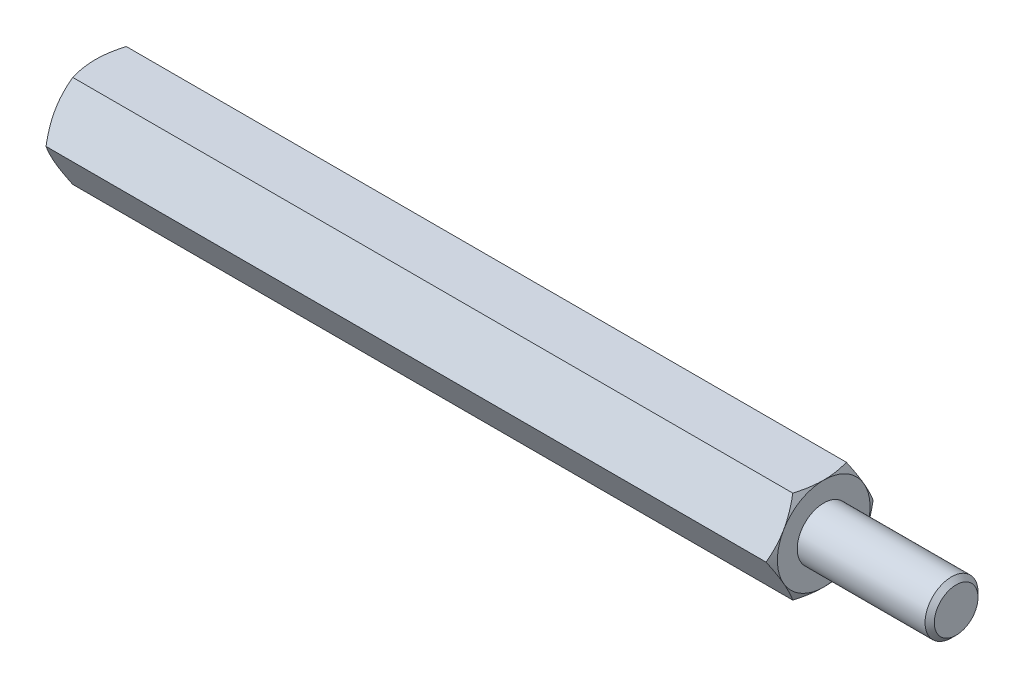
from build123d import *

# Parameters (mm, degrees)
EXTRUDE2_DEPTH = 27.5
SKETCH3_R      = 1.65
EXTRUDE3_DEPTH = 10
SKETCH5_R      = 2
EXTRUDE4_DEPTH = 10
CHAMFER1_SIZE  = 0.35


with BuildPart() as part:
    # Sketch1 → Extrude2 (new, symmetric)
    with BuildSketch(Plane(origin=(0, 0, 0), x_dir=(0, 0, -1), z_dir=(1, 0, 0))):
        Polygon((2.020725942, 3.5), (-2.020725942, 3.5), (-4.041451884, 0), (-2.020725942, -3.5), (2.020725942, -3.5), (4.041451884, 0), align=None)
    extrude(amount=EXTRUDE2_DEPTH, both=True)

    # Sketch2 → Cut-Revolve1 (revolve, cut)
    with BuildSketch(Plane.XY):
        with BuildLine():
            Line((-27.5, 3.5), (-26, 6.098076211))
            ThreePointArc((-26, 6.098076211), (-26.48810136, 7.276457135), (-27.5, 6.5))
            Line((-27.5, 6.5), (-27.5, 3.5))
        make_face()
    cut_revolve1 = revolve(axis=Axis((0, 0, 0), (1, 0, 0)), mode=Mode.SUBTRACT)

    # Mirror1: Cut-Revolve1 across plane
    add(cut_revolve1.mirror(Plane(origin=(0, 0, 0), x_dir=(0, 0, 1), z_dir=(1, 0, 0))), mode=Mode.SUBTRACT)

    # Sketch3 → Extrude3 (cut)
    with BuildSketch(Plane.ZY.offset(27.5)):
        Circle(SKETCH3_R)
    extrude(amount=-EXTRUDE3_DEPTH, mode=Mode.SUBTRACT)

    # Sketch4 → Cut-Revolve2 (revolve, cut)
    with BuildSketch(Plane.XY, mode=Mode.PRIVATE) as cut_revolve2_sk:
        Polygon((-17.5, 0), (-17.5, 1.65), (-16.547372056, 0), align=None)
    revolve(cut_revolve2_sk.sketch.rotate(Axis((-16.547372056, 0, 0), (-1, 0, 0)), 270), axis=Axis((-16.547372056, 0, 0), (-1, 0, 0)), mode=Mode.SUBTRACT)

    # Sketch5 → Extrude4 (add)
    with BuildSketch(Plane(origin=(27.5, 0, 0), x_dir=(0, 0, -1), z_dir=(1, 0, 0))):
        Circle(SKETCH5_R)
    extrude(amount=EXTRUDE4_DEPTH)

    # Chamfer1
    chamfer1_edges = [part.edges().sort_by_distance(p)[0] for p in [
        (37.5, 0, 2),
    ]]
    chamfer(chamfer1_edges, length=CHAMFER1_SIZE)


solid = part.part
